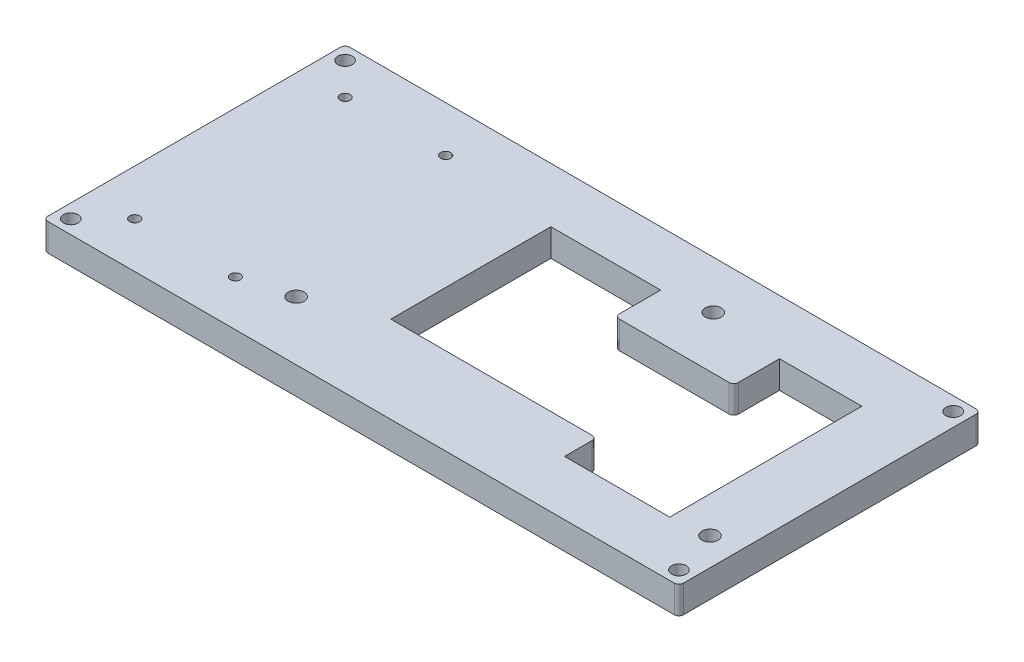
from build123d import *

# Parameters (mm, degrees)
ESQUISSE1_R             = 1.1
ESQUISSE1_R_2           = 1.75
ESQUISSE1_R_3           = 1.6
BOSS_EXTRU_1_DEPTH      = 6
ESQUISSE2_R             = 3.5
ENL_V_MAT_EXTRU_1_DEPTH = 3


with BuildPart() as part:
    # Esquisse1 → Boss.-Extru.1 (new body)
    with BuildSketch(Plane(origin=(0, 0, 0), x_dir=(1, 0, 0), z_dir=(0, 1, 0))):
        with BuildLine():
            Line((1, 0), (138, 0))
            ThreePointArc((138, 0), (138.707106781, 0.292893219), (139, 1))
            Line((139, 1), (139, 65))
            ThreePointArc((139, 65), (138.707106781, 65.707106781), (138, 66))
            Line((138, 66), (1, 66))
            ThreePointArc((1, 66), (0.292893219, 65.707106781), (0, 65))
            Line((0, 65), (0, 1))
            ThreePointArc((0, 1), (0.292893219, 0.292893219), (1, 0))
        make_face()
        with Locations(Location((32, 10, 0), (0, 0, 270))):
            Circle(ESQUISSE1_R, mode=Mode.SUBTRACT)
        with Locations(Location((10, 10, 0), (0, 0, 270))):
            Circle(ESQUISSE1_R, mode=Mode.SUBTRACT)
        with Locations(Location((10, 56, 0), (0, 0, 90))):
            Circle(ESQUISSE1_R, mode=Mode.SUBTRACT)
        with Locations(Location((32, 56, 0), (0, 0, 90))):
            Circle(ESQUISSE1_R, mode=Mode.SUBTRACT)
        with Locations(Location((42.4, 12.9, 0), (0, 0, 270))):
            Circle(ESQUISSE1_R_2, mode=Mode.SUBTRACT)
        with Locations(Location((136, 3, 0), (0, 0, 270))):
            Circle(ESQUISSE1_R_3, mode=Mode.SUBTRACT)
        with Locations(Location((132.9, 12.9, 0), (0, 0, 270))):
            Circle(ESQUISSE1_R_2, mode=Mode.SUBTRACT)
        with Locations(Location((3, 3, 0), (0, 0, 270))):
            Circle(ESQUISSE1_R_3, mode=Mode.SUBTRACT)
        with Locations(Location((136, 63, 0), (0, 0, 90))):
            Circle(ESQUISSE1_R_3, mode=Mode.SUBTRACT)
        with Locations(Location((3, 63, 0), (0, 0, 90))):
            Circle(ESQUISSE1_R_3, mode=Mode.SUBTRACT)
        with Locations(Location((91, 55.5, 0), (0, 0, 270))):
            Circle(ESQUISSE1_R_2, mode=Mode.SUBTRACT)
        with BuildLine():
            Line((125, 12), (102, 12))
            Line((102, 12), (102, 18))
            ThreePointArc((102, 18), (101.707106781, 18.707106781), (101, 19))
            Line((101, 19), (57, 19))
            Line((57, 19), (57, 54))
            Line((57, 54), (81, 54))
            Line((81, 54), (81, 45))
            ThreePointArc((81, 45), (81.292893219, 44.292893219), (82, 44))
            Line((82, 44), (106, 44))
            ThreePointArc((106, 44), (106.707106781, 44.292893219), (107, 45))
            Line((107, 45), (107, 54))
            Line((107, 54), (125, 54))
            Line((125, 54), (125, 12))
        make_face(mode=Mode.SUBTRACT)
    extrude(amount=BOSS_EXTRU_1_DEPTH)

    # Esquisse2 → Enl_v. mat.-Extru.1 (cut)
    with BuildSketch(Plane.XZ):
        with Locations(Location((132.9, -12.9, 0), (0, 0, 270))):
            Circle(ESQUISSE2_R)
        with Locations(Location((42.4, -12.9, 0), (0, 0, 270))):
            Circle(ESQUISSE2_R)
        with Locations(Location((91, -55.5, 0), (0, 0, 270))):
            Circle(ESQUISSE2_R)
    extrude(amount=-ENL_V_MAT_EXTRU_1_DEPTH, mode=Mode.SUBTRACT)


solid = part.part
